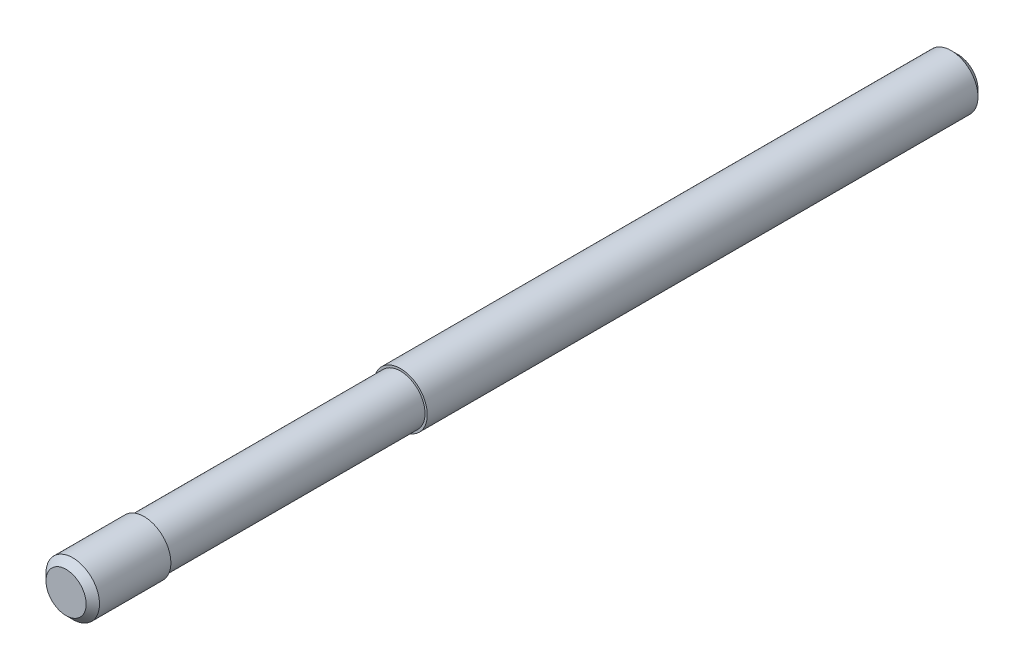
ISO-10303-21;
HEADER;
FILE_DESCRIPTION(('STEP AP214'),'2;1');
FILE_NAME('part.step','',(''),(''),'','','');
FILE_SCHEMA(('AUTOMOTIVE_DESIGN { 1 0 10303 214 1 1 1 1 }'));
ENDSEC;
DATA;
#1=APPLICATION_CONTEXT('core data for automotive mechanical design processes');
#2=APPLICATION_PROTOCOL_DEFINITION('international standard','automotive_design',2000,#1);
#3=PRODUCT_CONTEXT('',#1,'mechanical');
#4=PRODUCT('Part','Part','',(#3));
#5=PRODUCT_RELATED_PRODUCT_CATEGORY('part','',(#4));
#6=PRODUCT_DEFINITION_FORMATION('','',#4);
#7=PRODUCT_DEFINITION_CONTEXT('part definition',#1,'design');
#8=PRODUCT_DEFINITION('design','',#6,#7);
#9=PRODUCT_DEFINITION_SHAPE('','',#8);
#10=(LENGTH_UNIT() NAMED_UNIT(*) SI_UNIT(.MILLI.,.METRE.));
#11=(NAMED_UNIT(*) PLANE_ANGLE_UNIT() SI_UNIT($,.RADIAN.));
#12=(NAMED_UNIT(*) SI_UNIT($,.STERADIAN.) SOLID_ANGLE_UNIT());
#13=UNCERTAINTY_MEASURE_WITH_UNIT(LENGTH_MEASURE(1.E-05),#10,'distance_accuracy_value','');
#14=(GEOMETRIC_REPRESENTATION_CONTEXT(3) GLOBAL_UNCERTAINTY_ASSIGNED_CONTEXT((#13)) GLOBAL_UNIT_ASSIGNED_CONTEXT((#10,
#11,#12)) REPRESENTATION_CONTEXT('',''));
#15=CARTESIAN_POINT('',(0.,0.,0.));
#16=DIRECTION('',(0.,0.,1.));
#17=DIRECTION('',(1.,0.,0.));
#18=AXIS2_PLACEMENT_3D('',#15,#16,#17);
#19=CARTESIAN_POINT('',(-9.,0.,0.));
#20=DIRECTION('',(0.,0.,-1.));
#21=DIRECTION('',(-1.,0.,0.));
#22=AXIS2_PLACEMENT_3D('',#19,#20,#21);
#23=PLANE('',#22);
#24=CARTESIAN_POINT('',(0.,0.,0.));
#25=DIRECTION('',(0.,0.,-1.));
#26=DIRECTION('',(-1.,0.,0.));
#27=AXIS2_PLACEMENT_3D('',#24,#25,#26);
#28=CIRCLE('',#27,9.);
#29=CARTESIAN_POINT('',(-9.,0.,0.));
#30=VERTEX_POINT('',#29);
#31=EDGE_CURVE('E8',#30,#30,#28,.T.);
#32=ORIENTED_EDGE('',*,*,#31,.T.);
#33=EDGE_LOOP('',(#32));
#34=FACE_BOUND('',#33,.T.);
#35=ADVANCED_FACE('F12',(#34),#23,.T.);
#36=CARTESIAN_POINT('',(0.,0.,0.));
#37=DIRECTION('',(0.,0.,1.));
#38=DIRECTION('',(1.,0.,0.));
#39=AXIS2_PLACEMENT_3D('',#36,#37,#38);
#40=CONICAL_SURFACE('',#39,9.,0.785398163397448);
#41=CARTESIAN_POINT('',(0.,0.,3.));
#42=DIRECTION('',(0.,0.,-1.));
#43=DIRECTION('',(-1.,0.,0.));
#44=AXIS2_PLACEMENT_3D('',#41,#42,#43);
#45=CIRCLE('',#44,12.);
#46=CARTESIAN_POINT('',(-12.,0.,3.));
#47=VERTEX_POINT('',#46);
#48=EDGE_CURVE('E18',#47,#47,#45,.T.);
#49=ORIENTED_EDGE('',*,*,#48,.T.);
#50=EDGE_LOOP('',(#49));
#51=FACE_BOUND('',#50,.T.);
#52=ORIENTED_EDGE('',*,*,#31,.F.);
#53=EDGE_LOOP('',(#52));
#54=FACE_BOUND('',#53,.T.);
#55=ADVANCED_FACE('F57',(#51,#54),#40,.T.);
#56=CARTESIAN_POINT('',(0.,0.,0.));
#57=DIRECTION('',(0.,0.,-1.));
#58=DIRECTION('',(-1.,0.,0.));
#59=AXIS2_PLACEMENT_3D('',#56,#57,#58);
#60=CYLINDRICAL_SURFACE('',#59,12.);
#61=CARTESIAN_POINT('',(0.,0.,250.));
#62=DIRECTION('',(0.,0.,-1.));
#63=DIRECTION('',(-1.,0.,0.));
#64=AXIS2_PLACEMENT_3D('',#61,#62,#63);
#65=CIRCLE('',#64,12.);
#66=CARTESIAN_POINT('',(-12.,0.,250.));
#67=VERTEX_POINT('',#66);
#68=EDGE_CURVE('E22',#67,#67,#65,.T.);
#69=ORIENTED_EDGE('',*,*,#68,.T.);
#70=EDGE_LOOP('',(#69));
#71=FACE_BOUND('',#70,.T.);
#72=ORIENTED_EDGE('',*,*,#48,.F.);
#73=EDGE_LOOP('',(#72));
#74=FACE_BOUND('',#73,.T.);
#75=ADVANCED_FACE('F61',(#71,#74),#60,.T.);
#76=CARTESIAN_POINT('',(-11.,0.,250.));
#77=DIRECTION('',(0.,0.,1.));
#78=DIRECTION('',(1.,0.,0.));
#79=AXIS2_PLACEMENT_3D('',#76,#77,#78);
#80=PLANE('',#79);
#81=CARTESIAN_POINT('',(0.,0.,250.));
#82=DIRECTION('',(0.,0.,-1.));
#83=DIRECTION('',(-1.,0.,0.));
#84=AXIS2_PLACEMENT_3D('',#81,#82,#83);
#85=CIRCLE('',#84,11.);
#86=CARTESIAN_POINT('',(-11.,0.,250.));
#87=VERTEX_POINT('',#86);
#88=EDGE_CURVE('E26',#87,#87,#85,.T.);
#89=ORIENTED_EDGE('',*,*,#88,.T.);
#90=EDGE_LOOP('',(#89));
#91=FACE_BOUND('',#90,.T.);
#92=ORIENTED_EDGE('',*,*,#68,.F.);
#93=EDGE_LOOP('',(#92));
#94=FACE_BOUND('',#93,.T.);
#95=ADVANCED_FACE('F65',(#91,#94),#80,.T.);
#96=CARTESIAN_POINT('',(0.,0.,0.));
#97=DIRECTION('',(0.,0.,-1.));
#98=DIRECTION('',(-1.,0.,0.));
#99=AXIS2_PLACEMENT_3D('',#96,#97,#98);
#100=CYLINDRICAL_SURFACE('',#99,11.);
#101=CARTESIAN_POINT('',(0.,0.,365.));
#102=DIRECTION('',(0.,0.,-1.));
#103=DIRECTION('',(-1.,0.,0.));
#104=AXIS2_PLACEMENT_3D('',#101,#102,#103);
#105=CIRCLE('',#104,11.);
#106=CARTESIAN_POINT('',(-11.,0.,365.));
#107=VERTEX_POINT('',#106);
#108=EDGE_CURVE('E31',#107,#107,#105,.T.);
#109=ORIENTED_EDGE('',*,*,#108,.T.);
#110=EDGE_LOOP('',(#109));
#111=FACE_BOUND('',#110,.T.);
#112=ORIENTED_EDGE('',*,*,#88,.F.);
#113=EDGE_LOOP('',(#112));
#114=FACE_BOUND('',#113,.T.);
#115=ADVANCED_FACE('F72',(#111,#114),#100,.T.);
#116=CARTESIAN_POINT('',(-12.,0.,365.));
#117=DIRECTION('',(0.,0.,-1.));
#118=DIRECTION('',(-1.,0.,0.));
#119=AXIS2_PLACEMENT_3D('',#116,#117,#118);
#120=PLANE('',#119);
#121=CARTESIAN_POINT('',(0.,0.,365.));
#122=DIRECTION('',(0.,0.,-1.));
#123=DIRECTION('',(-1.,0.,0.));
#124=AXIS2_PLACEMENT_3D('',#121,#122,#123);
#125=CIRCLE('',#124,12.);
#126=CARTESIAN_POINT('',(-12.,0.,365.));
#127=VERTEX_POINT('',#126);
#128=EDGE_CURVE('E34',#127,#127,#125,.T.);
#129=ORIENTED_EDGE('',*,*,#128,.T.);
#130=EDGE_LOOP('',(#129));
#131=FACE_BOUND('',#130,.T.);
#132=ORIENTED_EDGE('',*,*,#108,.F.);
#133=EDGE_LOOP('',(#132));
#134=FACE_BOUND('',#133,.T.);
#135=ADVANCED_FACE('F76',(#131,#134),#120,.T.);
#136=CARTESIAN_POINT('',(0.,0.,0.));
#137=DIRECTION('',(0.,0.,-1.));
#138=DIRECTION('',(-1.,0.,0.));
#139=AXIS2_PLACEMENT_3D('',#136,#137,#138);
#140=CYLINDRICAL_SURFACE('',#139,12.);
#141=CARTESIAN_POINT('',(0.,0.,397.));
#142=DIRECTION('',(0.,0.,-1.));
#143=DIRECTION('',(-1.,0.,0.));
#144=AXIS2_PLACEMENT_3D('',#141,#142,#143);
#145=CIRCLE('',#144,12.);
#146=CARTESIAN_POINT('',(-12.,0.,397.));
#147=VERTEX_POINT('',#146);
#148=EDGE_CURVE('E37',#147,#147,#145,.T.);
#149=ORIENTED_EDGE('',*,*,#148,.T.);
#150=EDGE_LOOP('',(#149));
#151=FACE_BOUND('',#150,.T.);
#152=ORIENTED_EDGE('',*,*,#128,.F.);
#153=EDGE_LOOP('',(#152));
#154=FACE_BOUND('',#153,.T.);
#155=ADVANCED_FACE('F54',(#151,#154),#140,.T.);
#156=CARTESIAN_POINT('',(0.,0.,397.));
#157=DIRECTION('',(0.,0.,-1.));
#158=DIRECTION('',(-1.,0.,0.));
#159=AXIS2_PLACEMENT_3D('',#156,#157,#158);
#160=CONICAL_SURFACE('',#159,12.,0.785398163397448);
#161=CARTESIAN_POINT('',(0.,0.,400.));
#162=DIRECTION('',(0.,0.,-1.));
#163=DIRECTION('',(-1.,0.,0.));
#164=AXIS2_PLACEMENT_3D('',#161,#162,#163);
#165=CIRCLE('',#164,9.);
#166=CARTESIAN_POINT('',(-9.,0.,400.));
#167=VERTEX_POINT('',#166);
#168=EDGE_CURVE('E40',#167,#167,#165,.T.);
#169=ORIENTED_EDGE('',*,*,#168,.T.);
#170=EDGE_LOOP('',(#169));
#171=FACE_BOUND('',#170,.T.);
#172=ORIENTED_EDGE('',*,*,#148,.F.);
#173=EDGE_LOOP('',(#172));
#174=FACE_BOUND('',#173,.T.);
#175=ADVANCED_FACE('F44',(#171,#174),#160,.T.);
#176=CARTESIAN_POINT('',(0.,0.,400.));
#177=DIRECTION('',(0.,0.,1.));
#178=DIRECTION('',(1.,0.,0.));
#179=AXIS2_PLACEMENT_3D('',#176,#177,#178);
#180=PLANE('',#179);
#181=ORIENTED_EDGE('',*,*,#168,.F.);
#182=EDGE_LOOP('',(#181));
#183=FACE_BOUND('',#182,.T.);
#184=ADVANCED_FACE('F47',(#183),#180,.T.);
#185=CLOSED_SHELL('',(#35,#55,#75,#95,#115,#135,#155,#175,#184));
#186=MANIFOLD_SOLID_BREP('B1',#185);
#187=ADVANCED_BREP_SHAPE_REPRESENTATION('',(#18,#186),#14);
#188=SHAPE_DEFINITION_REPRESENTATION(#9,#187);
ENDSEC;
END-ISO-10303-21;
